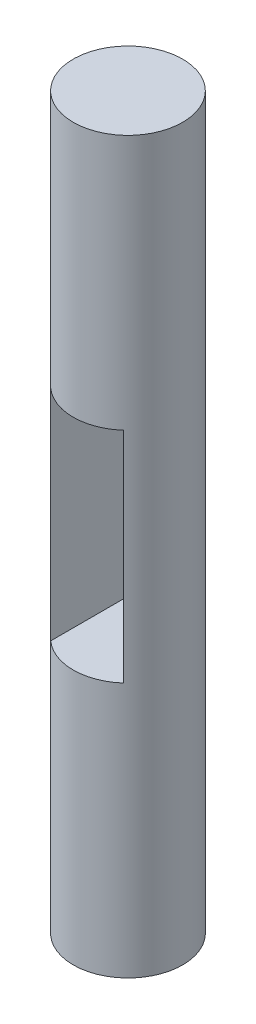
from build123d import *

# Parameters (mm, degrees)
SKETCH1_R                           = 9.525
BOSS_EXTRUDE1_DEPTH                 = 127
CUT_EXTRUDE1_REACH                  = 129.712
CUT_EXTRUDE1_END_RADIUS             = 9.525
CUT_EXTRUDE1_DIRECTION_2_REACH      = 129.712
CUT_EXTRUDE1_DIRECTION_2_END_RADIUS = 9.525


with BuildPart() as part:
    # Sketch1 → Boss-Extrude1 (new body)
    with BuildSketch(Plane(origin=(0, 0, 0), x_dir=(1, 0, 0), z_dir=(0, 1, 0))):
        with Locations(Location((0, 0, 0), (0, 0, 270))):
            Circle(SKETCH1_R)
    extrude(amount=BOSS_EXTRUDE1_DEPTH)

    # Cut-Extrude1: up to this cylinder (the profile starts inside it)
    cut_extrude1_end = Plane(origin=(0, 63.5, 0), z_dir=(0, -1, 0)) * Cylinder(CUT_EXTRUDE1_END_RADIUS, 279.474, mode=Mode.PRIVATE)
    # Sketch2 → Cut-Extrude1 (cut, up to the surface)
    with BuildSketch(Plane.XY, mode=Mode.PRIVATE) as cut_extrude1_sk1:
        Polygon((0, 44.45), (0, 63.5), (0, 82.55), (-6.35, 82.55), (-6.35, 63.5), (-6.35, 44.45), align=None)
    cut_extrude1_tool1 = extrude(cut_extrude1_sk1.sketch, amount=-CUT_EXTRUDE1_REACH, mode=Mode.PRIVATE) & cut_extrude1_end
    add(cut_extrude1_tool1.solids().sort_by_distance((-3.175, 63.5, 0))[0], mode=Mode.SUBTRACT)
    # Sketch2 → Cut-Extrude1 (cut, up to the surface)
    with BuildSketch(Plane.XY, mode=Mode.PRIVATE) as cut_extrude1_sk2:
        Polygon((0, 82.55), (0, 63.5), (0, 44.45), (6.35, 44.45), (6.35, 63.5), (6.35, 82.55), align=None)
    cut_extrude1_tool2 = extrude(cut_extrude1_sk2.sketch, amount=-CUT_EXTRUDE1_REACH, mode=Mode.PRIVATE) & cut_extrude1_end
    add(cut_extrude1_tool2.solids().sort_by_distance((3.175, 63.5, 0))[0], mode=Mode.SUBTRACT)

    # Cut-Extrude1 direction 2: up to this cylinder (the profile starts inside it)
    cut_extrude1_direction_2_end = Plane(origin=(0, 63.5, 0), z_dir=(0, -1, 0)) * Cylinder(CUT_EXTRUDE1_DIRECTION_2_END_RADIUS, 279.474, mode=Mode.PRIVATE)
    # Sketch2 → Cut-Extrude1 direction 2 (cut, up to the surface)
    with BuildSketch(Plane.XY, mode=Mode.PRIVATE) as cut_extrude1_direction_2_sk1:
        Polygon((0, 44.45), (0, 63.5), (0, 82.55), (-6.35, 82.55), (-6.35, 63.5), (-6.35, 44.45), align=None)
    cut_extrude1_direction_2_tool1 = extrude(cut_extrude1_direction_2_sk1.sketch, amount=CUT_EXTRUDE1_DIRECTION_2_REACH, mode=Mode.PRIVATE) & cut_extrude1_direction_2_end
    add(cut_extrude1_direction_2_tool1.solids().sort_by_distance((-3.175, 63.5, 0))[0], mode=Mode.SUBTRACT)
    # Sketch2 → Cut-Extrude1 direction 2 (cut, up to the surface)
    with BuildSketch(Plane.XY, mode=Mode.PRIVATE) as cut_extrude1_direction_2_sk2:
        Polygon((0, 82.55), (0, 63.5), (0, 44.45), (6.35, 44.45), (6.35, 63.5), (6.35, 82.55), align=None)
    cut_extrude1_direction_2_tool2 = extrude(cut_extrude1_direction_2_sk2.sketch, amount=CUT_EXTRUDE1_DIRECTION_2_REACH, mode=Mode.PRIVATE) & cut_extrude1_direction_2_end
    add(cut_extrude1_direction_2_tool2.solids().sort_by_distance((3.175, 63.5, 0))[0], mode=Mode.SUBTRACT)


solid = part.part
